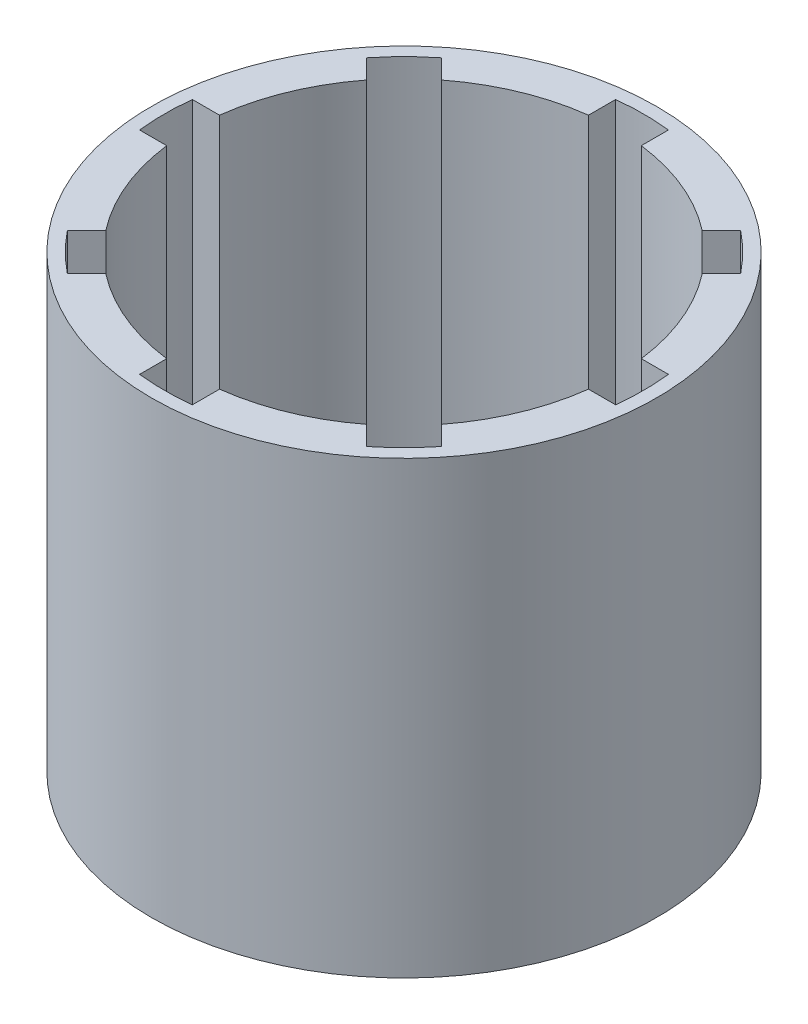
ISO-10303-21;
HEADER;
FILE_DESCRIPTION(('STEP AP214'),'2;1');
FILE_NAME('part.step','',(''),(''),'','','');
FILE_SCHEMA(('AUTOMOTIVE_DESIGN { 1 0 10303 214 1 1 1 1 }'));
ENDSEC;
DATA;
#1=APPLICATION_CONTEXT('core data for automotive mechanical design processes');
#2=APPLICATION_PROTOCOL_DEFINITION('international standard','automotive_design',2000,#1);
#3=PRODUCT_CONTEXT('',#1,'mechanical');
#4=PRODUCT('Part','Part','',(#3));
#5=PRODUCT_RELATED_PRODUCT_CATEGORY('part','',(#4));
#6=PRODUCT_DEFINITION_FORMATION('','',#4);
#7=PRODUCT_DEFINITION_CONTEXT('part definition',#1,'design');
#8=PRODUCT_DEFINITION('design','',#6,#7);
#9=PRODUCT_DEFINITION_SHAPE('','',#8);
#10=(LENGTH_UNIT() NAMED_UNIT(*) SI_UNIT(.MILLI.,.METRE.));
#11=(NAMED_UNIT(*) PLANE_ANGLE_UNIT() SI_UNIT($,.RADIAN.));
#12=(NAMED_UNIT(*) SI_UNIT($,.STERADIAN.) SOLID_ANGLE_UNIT());
#13=UNCERTAINTY_MEASURE_WITH_UNIT(LENGTH_MEASURE(1.E-05),#10,'distance_accuracy_value','');
#14=(GEOMETRIC_REPRESENTATION_CONTEXT(3) GLOBAL_UNCERTAINTY_ASSIGNED_CONTEXT((#13)) GLOBAL_UNIT_ASSIGNED_CONTEXT((#10,
#11,#12)) REPRESENTATION_CONTEXT('',''));
#15=CARTESIAN_POINT('',(0.,0.,0.));
#16=DIRECTION('',(0.,0.,1.));
#17=DIRECTION('',(1.,0.,0.));
#18=AXIS2_PLACEMENT_3D('',#15,#16,#17);
#19=CARTESIAN_POINT('',(0.,90.,0.));
#20=DIRECTION('',(0.,-1.,0.));
#21=DIRECTION('',(0.,0.,-1.));
#22=AXIS2_PLACEMENT_3D('',#19,#20,#21);
#23=CYLINDRICAL_SURFACE('',#22,42.5);
#24=DIRECTION('',(0.,-1.,0.));
#25=VECTOR('',#24,1.);
#26=CARTESIAN_POINT('',(-26.0858748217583,90.,-33.5526025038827));
#27=LINE('',#26,#25);
#28=CARTESIAN_POINT('',(-26.0858748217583,0.,-33.5526025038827));
#29=VERTEX_POINT('',#28);
#30=CARTESIAN_POINT('',(-26.0858748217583,90.,-33.5526025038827));
#31=VERTEX_POINT('',#30);
#32=EDGE_CURVE('E272',#29,#31,#27,.F.);
#33=ORIENTED_EDGE('',*,*,#32,.F.);
#34=CARTESIAN_POINT('',(0.,0.,0.));
#35=DIRECTION('',(0.,1.,0.));
#36=DIRECTION('',(0.,0.,1.));
#37=AXIS2_PLACEMENT_3D('',#34,#35,#36);
#38=CIRCLE('',#37,42.5);
#39=CARTESIAN_POINT('',(-5.27977377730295,0.,-42.170771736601));
#40=VERTEX_POINT('',#39);
#41=EDGE_CURVE('E436',#40,#29,#38,.T.);
#42=ORIENTED_EDGE('',*,*,#41,.F.);
#43=DIRECTION('',(0.,-1.,0.));
#44=VECTOR('',#43,1.);
#45=CARTESIAN_POINT('',(-5.27977377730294,90.,-42.170771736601));
#46=LINE('',#45,#44);
#47=CARTESIAN_POINT('',(-5.27977377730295,90.,-42.170771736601));
#48=VERTEX_POINT('',#47);
#49=EDGE_CURVE('E442',#48,#40,#46,.T.);
#50=ORIENTED_EDGE('',*,*,#49,.F.);
#51=CARTESIAN_POINT('',(0.,90.,0.));
#52=DIRECTION('',(0.,1.,0.));
#53=DIRECTION('',(0.,0.,1.));
#54=AXIS2_PLACEMENT_3D('',#51,#52,#53);
#55=CIRCLE('',#54,42.5);
#56=EDGE_CURVE('E430',#48,#31,#55,.T.);
#57=ORIENTED_EDGE('',*,*,#56,.T.);
#58=EDGE_LOOP('',(#33,#42,#50,#57));
#59=FACE_BOUND('',#58,.T.);
#60=ADVANCED_FACE('F35',(#59),#23,.F.);
#61=DIRECTION('',(0.,-1.,0.));
#62=VECTOR('',#61,1.);
#63=CARTESIAN_POINT('',(-33.5526025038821,90.,-26.0858748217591));
#64=LINE('',#63,#62);
#65=CARTESIAN_POINT('',(-33.5526025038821,90.,-26.0858748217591));
#66=VERTEX_POINT('',#65);
#67=CARTESIAN_POINT('',(-33.5526025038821,0.,-26.0858748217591));
#68=VERTEX_POINT('',#67);
#69=EDGE_CURVE('E50',#66,#68,#64,.T.);
#70=ORIENTED_EDGE('',*,*,#69,.F.);
#71=CARTESIAN_POINT('',(-42.1707717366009,90.,-5.27977377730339));
#72=VERTEX_POINT('',#71);
#73=EDGE_CURVE('E434',#66,#72,#55,.T.);
#74=ORIENTED_EDGE('',*,*,#73,.T.);
#75=DIRECTION('',(0.,-1.,0.));
#76=VECTOR('',#75,1.);
#77=CARTESIAN_POINT('',(-42.1707717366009,90.,-5.27977377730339));
#78=LINE('',#77,#76);
#79=CARTESIAN_POINT('',(-42.1707717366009,0.,-5.27977377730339));
#80=VERTEX_POINT('',#79);
#81=EDGE_CURVE('E292',#80,#72,#78,.F.);
#82=ORIENTED_EDGE('',*,*,#81,.F.);
#83=EDGE_CURVE('E438',#68,#80,#38,.T.);
#84=ORIENTED_EDGE('',*,*,#83,.F.);
#85=EDGE_LOOP('',(#70,#74,#82,#84));
#86=FACE_BOUND('',#85,.T.);
#87=ADVANCED_FACE('F473',(#86),#23,.F.);
#88=DIRECTION('',(0.,-1.,0.));
#89=VECTOR('',#88,1.);
#90=CARTESIAN_POINT('',(-42.170771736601,90.,5.2797737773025));
#91=LINE('',#90,#89);
#92=CARTESIAN_POINT('',(-42.170771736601,90.,5.2797737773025));
#93=VERTEX_POINT('',#92);
#94=CARTESIAN_POINT('',(-42.170771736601,0.,5.2797737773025));
#95=VERTEX_POINT('',#94);
#96=EDGE_CURVE('E58',#93,#95,#91,.T.);
#97=ORIENTED_EDGE('',*,*,#96,.F.);
#98=CARTESIAN_POINT('',(-33.5526025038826,90.,26.0858748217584));
#99=VERTEX_POINT('',#98);
#100=EDGE_CURVE('E476',#93,#99,#55,.T.);
#101=ORIENTED_EDGE('',*,*,#100,.T.);
#102=DIRECTION('',(0.,-1.,0.));
#103=VECTOR('',#102,1.);
#104=CARTESIAN_POINT('',(-33.5526025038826,90.,26.0858748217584));
#105=LINE('',#104,#103);
#106=CARTESIAN_POINT('',(-33.5526025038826,0.,26.0858748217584));
#107=VERTEX_POINT('',#106);
#108=EDGE_CURVE('E315',#107,#99,#105,.F.);
#109=ORIENTED_EDGE('',*,*,#108,.F.);
#110=EDGE_CURVE('E532',#95,#107,#38,.T.);
#111=ORIENTED_EDGE('',*,*,#110,.F.);
#112=EDGE_LOOP('',(#97,#101,#109,#111));
#113=FACE_BOUND('',#112,.T.);
#114=ADVANCED_FACE('F541',(#113),#23,.F.);
#115=DIRECTION('',(0.,-1.,0.));
#116=VECTOR('',#115,1.);
#117=CARTESIAN_POINT('',(-26.085874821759,90.,33.5526025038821));
#118=LINE('',#117,#116);
#119=CARTESIAN_POINT('',(-26.085874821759,90.,33.5526025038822));
#120=VERTEX_POINT('',#119);
#121=CARTESIAN_POINT('',(-26.085874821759,0.,33.5526025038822));
#122=VERTEX_POINT('',#121);
#123=EDGE_CURVE('E312',#120,#122,#118,.T.);
#124=ORIENTED_EDGE('',*,*,#123,.F.);
#125=CARTESIAN_POINT('',(-5.27977377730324,90.,42.170771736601));
#126=VERTEX_POINT('',#125);
#127=EDGE_CURVE('E477',#120,#126,#55,.T.);
#128=ORIENTED_EDGE('',*,*,#127,.T.);
#129=DIRECTION('',(0.,-1.,0.));
#130=VECTOR('',#129,1.);
#131=CARTESIAN_POINT('',(-5.27977377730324,90.,42.1707717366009));
#132=LINE('',#131,#130);
#133=CARTESIAN_POINT('',(-5.27977377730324,0.,42.170771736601));
#134=VERTEX_POINT('',#133);
#135=EDGE_CURVE('E338',#134,#126,#132,.F.);
#136=ORIENTED_EDGE('',*,*,#135,.F.);
#137=EDGE_CURVE('E529',#122,#134,#38,.T.);
#138=ORIENTED_EDGE('',*,*,#137,.F.);
#139=EDGE_LOOP('',(#124,#128,#136,#138));
#140=FACE_BOUND('',#139,.T.);
#141=ADVANCED_FACE('F543',(#140),#23,.F.);
#142=DIRECTION('',(0.,-1.,0.));
#143=VECTOR('',#142,1.);
#144=CARTESIAN_POINT('',(5.27977377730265,90.,42.170771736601));
#145=LINE('',#144,#143);
#146=CARTESIAN_POINT('',(5.27977377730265,90.,42.170771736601));
#147=VERTEX_POINT('',#146);
#148=CARTESIAN_POINT('',(5.27977377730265,0.,42.170771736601));
#149=VERTEX_POINT('',#148);
#150=EDGE_CURVE('E335',#147,#149,#145,.T.);
#151=ORIENTED_EDGE('',*,*,#150,.F.);
#152=CARTESIAN_POINT('',(26.0858748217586,90.,33.5526025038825));
#153=VERTEX_POINT('',#152);
#154=EDGE_CURVE('E481',#147,#153,#55,.T.);
#155=ORIENTED_EDGE('',*,*,#154,.T.);
#156=DIRECTION('',(0.,-1.,0.));
#157=VECTOR('',#156,1.);
#158=CARTESIAN_POINT('',(26.0858748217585,90.,33.5526025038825));
#159=LINE('',#158,#157);
#160=CARTESIAN_POINT('',(26.0858748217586,0.,33.5526025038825));
#161=VERTEX_POINT('',#160);
#162=EDGE_CURVE('E361',#161,#153,#159,.F.);
#163=ORIENTED_EDGE('',*,*,#162,.F.);
#164=EDGE_CURVE('E526',#149,#161,#38,.T.);
#165=ORIENTED_EDGE('',*,*,#164,.F.);
#166=EDGE_LOOP('',(#151,#155,#163,#165));
#167=FACE_BOUND('',#166,.T.);
#168=ADVANCED_FACE('F549',(#167),#23,.F.);
#169=DIRECTION('',(0.,-1.,0.));
#170=VECTOR('',#169,1.);
#171=CARTESIAN_POINT('',(33.5526025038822,90.,26.0858748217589));
#172=LINE('',#171,#170);
#173=CARTESIAN_POINT('',(33.5526025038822,90.,26.0858748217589));
#174=VERTEX_POINT('',#173);
#175=CARTESIAN_POINT('',(33.5526025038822,0.,26.0858748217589));
#176=VERTEX_POINT('',#175);
#177=EDGE_CURVE('E358',#174,#176,#172,.T.);
#178=ORIENTED_EDGE('',*,*,#177,.F.);
#179=CARTESIAN_POINT('',(42.170771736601,90.,5.27977377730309));
#180=VERTEX_POINT('',#179);
#181=EDGE_CURVE('E486',#174,#180,#55,.T.);
#182=ORIENTED_EDGE('',*,*,#181,.T.);
#183=DIRECTION('',(0.,-1.,0.));
#184=VECTOR('',#183,1.);
#185=CARTESIAN_POINT('',(42.170771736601,90.,5.27977377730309));
#186=LINE('',#185,#184);
#187=CARTESIAN_POINT('',(42.170771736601,0.,5.27977377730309));
#188=VERTEX_POINT('',#187);
#189=EDGE_CURVE('E384',#188,#180,#186,.F.);
#190=ORIENTED_EDGE('',*,*,#189,.F.);
#191=EDGE_CURVE('E523',#176,#188,#38,.T.);
#192=ORIENTED_EDGE('',*,*,#191,.F.);
#193=EDGE_LOOP('',(#178,#182,#190,#192));
#194=FACE_BOUND('',#193,.T.);
#195=ADVANCED_FACE('F565',(#194),#23,.F.);
#196=DIRECTION('',(0.,-1.,0.));
#197=VECTOR('',#196,1.);
#198=CARTESIAN_POINT('',(42.170771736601,90.,-5.2797737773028));
#199=LINE('',#198,#197);
#200=CARTESIAN_POINT('',(42.170771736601,90.,-5.2797737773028));
#201=VERTEX_POINT('',#200);
#202=CARTESIAN_POINT('',(42.170771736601,0.,-5.2797737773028));
#203=VERTEX_POINT('',#202);
#204=EDGE_CURVE('E381',#201,#203,#199,.T.);
#205=ORIENTED_EDGE('',*,*,#204,.F.);
#206=CARTESIAN_POINT('',(33.5526025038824,90.,-26.0858748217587));
#207=VERTEX_POINT('',#206);
#208=EDGE_CURVE('E491',#201,#207,#55,.T.);
#209=ORIENTED_EDGE('',*,*,#208,.T.);
#210=DIRECTION('',(0.,-1.,0.));
#211=VECTOR('',#210,1.);
#212=CARTESIAN_POINT('',(33.5526025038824,90.,-26.0858748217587));
#213=LINE('',#212,#211);
#214=CARTESIAN_POINT('',(33.5526025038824,0.,-26.0858748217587));
#215=VERTEX_POINT('',#214);
#216=EDGE_CURVE('E451',#215,#207,#213,.F.);
#217=ORIENTED_EDGE('',*,*,#216,.F.);
#218=EDGE_CURVE('E522',#203,#215,#38,.T.);
#219=ORIENTED_EDGE('',*,*,#218,.F.);
#220=EDGE_LOOP('',(#205,#209,#217,#219));
#221=FACE_BOUND('',#220,.T.);
#222=ADVANCED_FACE('F558',(#221),#23,.F.);
#223=CARTESIAN_POINT('',(0.,90.,0.));
#224=DIRECTION('',(0.,1.,0.));
#225=DIRECTION('',(0.,0.,1.));
#226=AXIS2_PLACEMENT_3D('',#223,#224,#225);
#227=PLANE('',#226);
#228=DIRECTION('',(-0.707106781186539,0.,-0.707106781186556));
#229=VECTOR('',#228,1.);
#230=CARTESIAN_POINT('',(-29.9281134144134,90.,-37.3948410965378));
#231=LINE('',#230,#229);
#232=CARTESIAN_POINT('',(-29.9281134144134,90.,-37.3948410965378));
#233=VERTEX_POINT('',#232);
#234=EDGE_CURVE('E263',#31,#233,#231,.T.);
#235=ORIENTED_EDGE('',*,*,#234,.F.);
#236=ORIENTED_EDGE('',*,*,#56,.F.);
#237=DIRECTION('',(0.,0.,1.));
#238=VECTOR('',#237,1.);
#239=CARTESIAN_POINT('',(-5.27977377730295,90.,-47.6045176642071));
#240=LINE('',#239,#238);
#241=CARTESIAN_POINT('',(-5.27977377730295,90.,-47.6045176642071));
#242=VERTEX_POINT('',#241);
#243=EDGE_CURVE('E422',#242,#48,#240,.T.);
#244=ORIENTED_EDGE('',*,*,#243,.F.);
#245=CARTESIAN_POINT('',(0.,90.,0.));
#246=DIRECTION('',(0.,1.,0.));
#247=DIRECTION('',(0.,0.,-1.));
#248=AXIS2_PLACEMENT_3D('',#245,#246,#247);
#249=CIRCLE('',#248,47.8964102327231);
#250=CARTESIAN_POINT('',(5.27977377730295,90.,-47.6045176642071));
#251=VERTEX_POINT('',#250);
#252=EDGE_CURVE('E407',#251,#242,#249,.T.);
#253=ORIENTED_EDGE('',*,*,#252,.F.);
#254=DIRECTION('',(0.,0.,-1.));
#255=VECTOR('',#254,1.);
#256=CARTESIAN_POINT('',(5.27977377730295,90.,-47.6045176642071));
#257=LINE('',#256,#255);
#258=CARTESIAN_POINT('',(5.27977377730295,90.,-42.170771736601));
#259=VERTEX_POINT('',#258);
#260=EDGE_CURVE('E413',#259,#251,#257,.T.);
#261=ORIENTED_EDGE('',*,*,#260,.F.);
#262=CARTESIAN_POINT('',(26.0858748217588,90.,-33.5526025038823));
#263=VERTEX_POINT('',#262);
#264=EDGE_CURVE('E435',#263,#259,#55,.T.);
#265=ORIENTED_EDGE('',*,*,#264,.F.);
#266=DIRECTION('',(-0.707106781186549,0.,0.707106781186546));
#267=VECTOR('',#266,1.);
#268=CARTESIAN_POINT('',(29.9281134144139,90.,-37.3948410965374));
#269=LINE('',#268,#267);
#270=CARTESIAN_POINT('',(29.9281134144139,90.,-37.3948410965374));
#271=VERTEX_POINT('',#270);
#272=EDGE_CURVE('E401',#271,#263,#269,.T.);
#273=ORIENTED_EDGE('',*,*,#272,.F.);
#274=CARTESIAN_POINT('',(0.,90.,0.));
#275=DIRECTION('',(0.,1.,0.));
#276=DIRECTION('',(0.,0.,-1.));
#277=AXIS2_PLACEMENT_3D('',#274,#275,#276);
#278=CIRCLE('',#277,47.8964102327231);
#279=CARTESIAN_POINT('',(37.3948410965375,90.,-29.9281134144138));
#280=VERTEX_POINT('',#279);
#281=EDGE_CURVE('E387',#280,#271,#278,.T.);
#282=ORIENTED_EDGE('',*,*,#281,.F.);
#283=DIRECTION('',(0.707106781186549,0.,-0.707106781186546));
#284=VECTOR('',#283,1.);
#285=CARTESIAN_POINT('',(37.3948410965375,90.,-29.9281134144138));
#286=LINE('',#285,#284);
#287=EDGE_CURVE('E392',#207,#280,#286,.T.);
#288=ORIENTED_EDGE('',*,*,#287,.F.);
#289=ORIENTED_EDGE('',*,*,#208,.F.);
#290=DIRECTION('',(-1.,0.,0.));
#291=VECTOR('',#290,1.);
#292=CARTESIAN_POINT('',(47.6045176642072,90.,-5.27977377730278));
#293=LINE('',#292,#291);
#294=CARTESIAN_POINT('',(47.6045176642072,90.,-5.27977377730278));
#295=VERTEX_POINT('',#294);
#296=EDGE_CURVE('E375',#295,#201,#293,.T.);
#297=ORIENTED_EDGE('',*,*,#296,.F.);
#298=CARTESIAN_POINT('',(0.,90.,0.));
#299=DIRECTION('',(0.,1.,0.));
#300=DIRECTION('',(0.,0.,-1.));
#301=AXIS2_PLACEMENT_3D('',#298,#299,#300);
#302=CIRCLE('',#301,47.8964102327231);
#303=CARTESIAN_POINT('',(47.6045176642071,90.,5.27977377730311));
#304=VERTEX_POINT('',#303);
#305=EDGE_CURVE('E364',#304,#295,#302,.T.);
#306=ORIENTED_EDGE('',*,*,#305,.F.);
#307=DIRECTION('',(1.,0.,0.));
#308=VECTOR('',#307,1.);
#309=CARTESIAN_POINT('',(47.6045176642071,90.,5.27977377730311));
#310=LINE('',#309,#308);
#311=EDGE_CURVE('E369',#180,#304,#310,.T.);
#312=ORIENTED_EDGE('',*,*,#311,.F.);
#313=ORIENTED_EDGE('',*,*,#181,.F.);
#314=DIRECTION('',(-0.707106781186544,0.,-0.707106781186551));
#315=VECTOR('',#314,1.);
#316=CARTESIAN_POINT('',(37.3948410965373,90.,29.928113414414));
#317=LINE('',#316,#315);
#318=CARTESIAN_POINT('',(37.3948410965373,90.,29.928113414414));
#319=VERTEX_POINT('',#318);
#320=EDGE_CURVE('E352',#319,#174,#317,.T.);
#321=ORIENTED_EDGE('',*,*,#320,.F.);
#322=CARTESIAN_POINT('',(0.,90.,0.));
#323=DIRECTION('',(0.,1.,0.));
#324=DIRECTION('',(0.,0.,-1.));
#325=AXIS2_PLACEMENT_3D('',#322,#323,#324);
#326=CIRCLE('',#325,47.8964102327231);
#327=CARTESIAN_POINT('',(29.9281134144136,90.,37.3948410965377));
#328=VERTEX_POINT('',#327);
#329=EDGE_CURVE('E341',#328,#319,#326,.T.);
#330=ORIENTED_EDGE('',*,*,#329,.F.);
#331=DIRECTION('',(0.707106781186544,0.,0.707106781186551));
#332=VECTOR('',#331,1.);
#333=CARTESIAN_POINT('',(29.9281134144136,90.,37.3948410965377));
#334=LINE('',#333,#332);
#335=EDGE_CURVE('E346',#153,#328,#334,.T.);
#336=ORIENTED_EDGE('',*,*,#335,.F.);
#337=ORIENTED_EDGE('',*,*,#154,.F.);
#338=DIRECTION('',(0.,0.,-1.));
#339=VECTOR('',#338,1.);
#340=CARTESIAN_POINT('',(5.27977377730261,90.,47.6045176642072));
#341=LINE('',#340,#339);
#342=CARTESIAN_POINT('',(5.27977377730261,90.,47.6045176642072));
#343=VERTEX_POINT('',#342);
#344=EDGE_CURVE('E329',#343,#147,#341,.T.);
#345=ORIENTED_EDGE('',*,*,#344,.F.);
#346=CARTESIAN_POINT('',(0.,90.,0.));
#347=DIRECTION('',(0.,1.,0.));
#348=DIRECTION('',(0.,0.,-1.));
#349=AXIS2_PLACEMENT_3D('',#346,#347,#348);
#350=CIRCLE('',#349,47.8964102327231);
#351=CARTESIAN_POINT('',(-5.27977377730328,90.,47.6045176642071));
#352=VERTEX_POINT('',#351);
#353=EDGE_CURVE('E318',#352,#343,#350,.T.);
#354=ORIENTED_EDGE('',*,*,#353,.F.);
#355=DIRECTION('',(0.,0.,1.));
#356=VECTOR('',#355,1.);
#357=CARTESIAN_POINT('',(-5.27977377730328,90.,47.6045176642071));
#358=LINE('',#357,#356);
#359=EDGE_CURVE('E323',#126,#352,#358,.T.);
#360=ORIENTED_EDGE('',*,*,#359,.F.);
#361=ORIENTED_EDGE('',*,*,#127,.F.);
#362=DIRECTION('',(0.707106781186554,0.,-0.707106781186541));
#363=VECTOR('',#362,1.);
#364=CARTESIAN_POINT('',(-29.9281134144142,90.,37.3948410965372));
#365=LINE('',#364,#363);
#366=CARTESIAN_POINT('',(-29.9281134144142,90.,37.3948410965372));
#367=VERTEX_POINT('',#366);
#368=EDGE_CURVE('E306',#367,#120,#365,.T.);
#369=ORIENTED_EDGE('',*,*,#368,.F.);
#370=CARTESIAN_POINT('',(0.,90.,0.));
#371=DIRECTION('',(0.,1.,0.));
#372=DIRECTION('',(0.,0.,-1.));
#373=AXIS2_PLACEMENT_3D('',#370,#371,#372);
#374=CIRCLE('',#373,47.8964102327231);
#375=CARTESIAN_POINT('',(-37.3948410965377,90.,29.9281134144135));
#376=VERTEX_POINT('',#375);
#377=EDGE_CURVE('E295',#376,#367,#374,.T.);
#378=ORIENTED_EDGE('',*,*,#377,.F.);
#379=DIRECTION('',(-0.707106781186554,0.,0.707106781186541));
#380=VECTOR('',#379,1.);
#381=CARTESIAN_POINT('',(-37.3948410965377,90.,29.9281134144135));
#382=LINE('',#381,#380);
#383=EDGE_CURVE('E300',#99,#376,#382,.T.);
#384=ORIENTED_EDGE('',*,*,#383,.F.);
#385=ORIENTED_EDGE('',*,*,#100,.F.);
#386=DIRECTION('',(1.,0.,0.));
#387=VECTOR('',#386,1.);
#388=CARTESIAN_POINT('',(-47.6045176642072,90.,5.27977377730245));
#389=LINE('',#388,#387);
#390=CARTESIAN_POINT('',(-47.6045176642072,90.,5.27977377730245));
#391=VERTEX_POINT('',#390);
#392=EDGE_CURVE('E284',#391,#93,#389,.T.);
#393=ORIENTED_EDGE('',*,*,#392,.F.);
#394=CARTESIAN_POINT('',(0.,90.,0.));
#395=DIRECTION('',(0.,1.,0.));
#396=DIRECTION('',(0.,0.,-1.));
#397=AXIS2_PLACEMENT_3D('',#394,#395,#396);
#398=CIRCLE('',#397,47.8964102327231);
#399=CARTESIAN_POINT('',(-47.6045176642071,90.,-5.27977377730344));
#400=VERTEX_POINT('',#399);
#401=EDGE_CURVE('E274',#400,#391,#398,.T.);
#402=ORIENTED_EDGE('',*,*,#401,.F.);
#403=DIRECTION('',(-1.,0.,0.));
#404=VECTOR('',#403,1.);
#405=CARTESIAN_POINT('',(-47.6045176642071,90.,-5.27977377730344));
#406=LINE('',#405,#404);
#407=EDGE_CURVE('E279',#72,#400,#406,.T.);
#408=ORIENTED_EDGE('',*,*,#407,.F.);
#409=ORIENTED_EDGE('',*,*,#73,.F.);
#410=DIRECTION('',(0.707106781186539,0.,0.707106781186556));
#411=VECTOR('',#410,1.);
#412=CARTESIAN_POINT('',(-37.3948410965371,90.,-29.9281134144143));
#413=LINE('',#412,#411);
#414=CARTESIAN_POINT('',(-37.3948410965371,90.,-29.9281134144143));
#415=VERTEX_POINT('',#414);
#416=EDGE_CURVE('E265',#415,#66,#413,.T.);
#417=ORIENTED_EDGE('',*,*,#416,.F.);
#418=CARTESIAN_POINT('',(0.,90.,0.));
#419=DIRECTION('',(0.,1.,0.));
#420=DIRECTION('',(0.,0.,-1.));
#421=AXIS2_PLACEMENT_3D('',#418,#419,#420);
#422=CIRCLE('',#421,47.8964102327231);
#423=EDGE_CURVE('E252',#233,#415,#422,.T.);
#424=ORIENTED_EDGE('',*,*,#423,.F.);
#425=EDGE_LOOP('',(#235,#236,#244,#253,#261,#265,#273,#282,#288,#289,#297,#306,#312,#313,#321,
#330,#336,#337,#345,#354,#360,#361,#369,#378,#384,#385,#393,#402,#408,#409,#417,#424));
#426=FACE_BOUND('',#425,.T.);
#427=CARTESIAN_POINT('',(0.,90.,0.));
#428=DIRECTION('',(0.,1.,0.));
#429=DIRECTION('',(0.,0.,1.));
#430=AXIS2_PLACEMENT_3D('',#427,#428,#429);
#431=CIRCLE('',#430,50.5);
#432=CARTESIAN_POINT('',(0.,90.,-50.5));
#433=VERTEX_POINT('',#432);
#434=EDGE_CURVE('E439',#433,#433,#431,.T.);
#435=ORIENTED_EDGE('',*,*,#434,.T.);
#436=EDGE_LOOP('',(#435));
#437=FACE_BOUND('',#436,.T.);
#438=ADVANCED_FACE('F513',(#426,#437),#227,.T.);
#439=CARTESIAN_POINT('',(0.,0.,0.));
#440=DIRECTION('',(0.,1.,0.));
#441=DIRECTION('',(0.,0.,1.));
#442=AXIS2_PLACEMENT_3D('',#439,#440,#441);
#443=PLANE('',#442);
#444=CARTESIAN_POINT('',(0.,0.,0.));
#445=DIRECTION('',(0.,1.,0.));
#446=DIRECTION('',(0.,0.,1.));
#447=AXIS2_PLACEMENT_3D('',#444,#445,#446);
#448=CIRCLE('',#447,50.5);
#449=CARTESIAN_POINT('',(0.,0.,-50.5));
#450=VERTEX_POINT('',#449);
#451=EDGE_CURVE('E433',#450,#450,#448,.T.);
#452=ORIENTED_EDGE('',*,*,#451,.F.);
#453=EDGE_LOOP('',(#452));
#454=FACE_BOUND('',#453,.T.);
#455=ORIENTED_EDGE('',*,*,#41,.T.);
#456=DIRECTION('',(-0.707106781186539,0.,-0.707106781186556));
#457=VECTOR('',#456,1.);
#458=CARTESIAN_POINT('',(3.73336384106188,0.,-3.73336384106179));
#459=LINE('',#458,#457);
#460=CARTESIAN_POINT('',(-29.9281134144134,0.,-37.3948410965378));
#461=VERTEX_POINT('',#460);
#462=EDGE_CURVE('E11',#29,#461,#459,.T.);
#463=ORIENTED_EDGE('',*,*,#462,.T.);
#464=CARTESIAN_POINT('',(0.,0.,0.));
#465=DIRECTION('',(0.,1.,0.));
#466=DIRECTION('',(0.,0.,-1.));
#467=AXIS2_PLACEMENT_3D('',#464,#465,#466);
#468=CIRCLE('',#467,47.8964102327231);
#469=CARTESIAN_POINT('',(-37.3948410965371,0.,-29.9281134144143));
#470=VERTEX_POINT('',#469);
#471=EDGE_CURVE('E250',#461,#470,#468,.T.);
#472=ORIENTED_EDGE('',*,*,#471,.T.);
#473=DIRECTION('',(0.707106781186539,0.,0.707106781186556));
#474=VECTOR('',#473,1.);
#475=CARTESIAN_POINT('',(-37.3948410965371,0.,-29.9281134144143));
#476=LINE('',#475,#474);
#477=EDGE_CURVE('E255',#470,#68,#476,.T.);
#478=ORIENTED_EDGE('',*,*,#477,.T.);
#479=ORIENTED_EDGE('',*,*,#83,.T.);
#480=DIRECTION('',(-1.,0.,0.));
#481=VECTOR('',#480,1.);
#482=CARTESIAN_POINT('',(0.,0.,-5.27977377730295));
#483=LINE('',#482,#481);
#484=CARTESIAN_POINT('',(-47.6045176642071,0.,-5.27977377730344));
#485=VERTEX_POINT('',#484);
#486=EDGE_CURVE('E43',#80,#485,#483,.T.);
#487=ORIENTED_EDGE('',*,*,#486,.T.);
#488=CARTESIAN_POINT('',(0.,0.,0.));
#489=DIRECTION('',(0.,1.,0.));
#490=DIRECTION('',(0.,0.,-1.));
#491=AXIS2_PLACEMENT_3D('',#488,#489,#490);
#492=CIRCLE('',#491,47.8964102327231);
#493=CARTESIAN_POINT('',(-47.6045176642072,0.,5.27977377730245));
#494=VERTEX_POINT('',#493);
#495=EDGE_CURVE('E275',#485,#494,#492,.T.);
#496=ORIENTED_EDGE('',*,*,#495,.T.);
#497=DIRECTION('',(1.,0.,0.));
#498=VECTOR('',#497,1.);
#499=CARTESIAN_POINT('',(-47.6045176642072,0.,5.27977377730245));
#500=LINE('',#499,#498);
#501=EDGE_CURVE('E278',#494,#95,#500,.T.);
#502=ORIENTED_EDGE('',*,*,#501,.T.);
#503=ORIENTED_EDGE('',*,*,#110,.T.);
#504=DIRECTION('',(-0.707106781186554,0.,0.707106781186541));
#505=VECTOR('',#504,1.);
#506=CARTESIAN_POINT('',(-3.73336384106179,0.,-3.73336384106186));
#507=LINE('',#506,#505);
#508=CARTESIAN_POINT('',(-37.3948410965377,0.,29.9281134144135));
#509=VERTEX_POINT('',#508);
#510=EDGE_CURVE('E463',#107,#509,#507,.T.);
#511=ORIENTED_EDGE('',*,*,#510,.T.);
#512=CARTESIAN_POINT('',(0.,0.,0.));
#513=DIRECTION('',(0.,1.,0.));
#514=DIRECTION('',(0.,0.,-1.));
#515=AXIS2_PLACEMENT_3D('',#512,#513,#514);
#516=CIRCLE('',#515,47.8964102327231);
#517=CARTESIAN_POINT('',(-29.9281134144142,0.,37.3948410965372));
#518=VERTEX_POINT('',#517);
#519=EDGE_CURVE('E296',#509,#518,#516,.T.);
#520=ORIENTED_EDGE('',*,*,#519,.T.);
#521=DIRECTION('',(0.707106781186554,0.,-0.707106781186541));
#522=VECTOR('',#521,1.);
#523=CARTESIAN_POINT('',(-29.9281134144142,0.,37.3948410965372));
#524=LINE('',#523,#522);
#525=EDGE_CURVE('E299',#518,#122,#524,.T.);
#526=ORIENTED_EDGE('',*,*,#525,.T.);
#527=ORIENTED_EDGE('',*,*,#137,.T.);
#528=DIRECTION('',(0.,0.,1.));
#529=VECTOR('',#528,1.);
#530=CARTESIAN_POINT('',(-5.27977377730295,0.,0.));
#531=LINE('',#530,#529);
#532=CARTESIAN_POINT('',(-5.27977377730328,0.,47.6045176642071));
#533=VERTEX_POINT('',#532);
#534=EDGE_CURVE('E460',#134,#533,#531,.T.);
#535=ORIENTED_EDGE('',*,*,#534,.T.);
#536=CARTESIAN_POINT('',(0.,0.,0.));
#537=DIRECTION('',(0.,1.,0.));
#538=DIRECTION('',(0.,0.,-1.));
#539=AXIS2_PLACEMENT_3D('',#536,#537,#538);
#540=CIRCLE('',#539,47.8964102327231);
#541=CARTESIAN_POINT('',(5.27977377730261,0.,47.6045176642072));
#542=VERTEX_POINT('',#541);
#543=EDGE_CURVE('E319',#533,#542,#540,.T.);
#544=ORIENTED_EDGE('',*,*,#543,.T.);
#545=DIRECTION('',(0.,0.,-1.));
#546=VECTOR('',#545,1.);
#547=CARTESIAN_POINT('',(5.27977377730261,0.,47.6045176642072));
#548=LINE('',#547,#546);
#549=EDGE_CURVE('E322',#542,#149,#548,.T.);
#550=ORIENTED_EDGE('',*,*,#549,.T.);
#551=ORIENTED_EDGE('',*,*,#164,.T.);
#552=DIRECTION('',(0.707106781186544,0.,0.707106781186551));
#553=VECTOR('',#552,1.);
#554=CARTESIAN_POINT('',(-3.73336384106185,0.,3.73336384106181));
#555=LINE('',#554,#553);
#556=CARTESIAN_POINT('',(29.9281134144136,0.,37.3948410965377));
#557=VERTEX_POINT('',#556);
#558=EDGE_CURVE('E457',#161,#557,#555,.T.);
#559=ORIENTED_EDGE('',*,*,#558,.T.);
#560=CARTESIAN_POINT('',(0.,0.,0.));
#561=DIRECTION('',(0.,1.,0.));
#562=DIRECTION('',(0.,0.,-1.));
#563=AXIS2_PLACEMENT_3D('',#560,#561,#562);
#564=CIRCLE('',#563,47.8964102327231);
#565=CARTESIAN_POINT('',(37.3948410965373,0.,29.928113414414));
#566=VERTEX_POINT('',#565);
#567=EDGE_CURVE('E342',#557,#566,#564,.T.);
#568=ORIENTED_EDGE('',*,*,#567,.T.);
#569=DIRECTION('',(-0.707106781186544,0.,-0.707106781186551));
#570=VECTOR('',#569,1.);
#571=CARTESIAN_POINT('',(37.3948410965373,0.,29.928113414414));
#572=LINE('',#571,#570);
#573=EDGE_CURVE('E345',#566,#176,#572,.T.);
#574=ORIENTED_EDGE('',*,*,#573,.T.);
#575=ORIENTED_EDGE('',*,*,#191,.T.);
#576=DIRECTION('',(1.,0.,0.));
#577=VECTOR('',#576,1.);
#578=CARTESIAN_POINT('',(0.,0.,5.27977377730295));
#579=LINE('',#578,#577);
#580=CARTESIAN_POINT('',(47.6045176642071,0.,5.27977377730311));
#581=VERTEX_POINT('',#580);
#582=EDGE_CURVE('E454',#188,#581,#579,.T.);
#583=ORIENTED_EDGE('',*,*,#582,.T.);
#584=CARTESIAN_POINT('',(0.,0.,0.));
#585=DIRECTION('',(0.,1.,0.));
#586=DIRECTION('',(0.,0.,-1.));
#587=AXIS2_PLACEMENT_3D('',#584,#585,#586);
#588=CIRCLE('',#587,47.8964102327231);
#589=CARTESIAN_POINT('',(47.6045176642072,0.,-5.27977377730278));
#590=VERTEX_POINT('',#589);
#591=EDGE_CURVE('E365',#581,#590,#588,.T.);
#592=ORIENTED_EDGE('',*,*,#591,.T.);
#593=DIRECTION('',(-1.,0.,0.));
#594=VECTOR('',#593,1.);
#595=CARTESIAN_POINT('',(47.6045176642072,0.,-5.27977377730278));
#596=LINE('',#595,#594);
#597=EDGE_CURVE('E368',#590,#203,#596,.T.);
#598=ORIENTED_EDGE('',*,*,#597,.T.);
#599=ORIENTED_EDGE('',*,*,#218,.T.);
#600=DIRECTION('',(0.707106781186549,0.,-0.707106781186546));
#601=VECTOR('',#600,1.);
#602=CARTESIAN_POINT('',(37.3948410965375,0.,-29.9281134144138));
#603=LINE('',#602,#601);
#604=CARTESIAN_POINT('',(37.3948410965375,0.,-29.9281134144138));
#605=VERTEX_POINT('',#604);
#606=EDGE_CURVE('E395',#215,#605,#603,.T.);
#607=ORIENTED_EDGE('',*,*,#606,.T.);
#608=CARTESIAN_POINT('',(0.,0.,0.));
#609=DIRECTION('',(0.,1.,0.));
#610=DIRECTION('',(0.,0.,-1.));
#611=AXIS2_PLACEMENT_3D('',#608,#609,#610);
#612=CIRCLE('',#611,47.8964102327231);
#613=CARTESIAN_POINT('',(29.9281134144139,0.,-37.3948410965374));
#614=VERTEX_POINT('',#613);
#615=EDGE_CURVE('E388',#605,#614,#612,.T.);
#616=ORIENTED_EDGE('',*,*,#615,.T.);
#617=DIRECTION('',(-0.707106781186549,0.,0.707106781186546));
#618=VECTOR('',#617,1.);
#619=CARTESIAN_POINT('',(29.9281134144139,0.,-37.3948410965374));
#620=LINE('',#619,#618);
#621=CARTESIAN_POINT('',(26.0858748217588,0.,-33.5526025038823));
#622=VERTEX_POINT('',#621);
#623=EDGE_CURVE('E391',#614,#622,#620,.T.);
#624=ORIENTED_EDGE('',*,*,#623,.T.);
#625=CARTESIAN_POINT('',(5.27977377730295,0.,-42.170771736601));
#626=VERTEX_POINT('',#625);
#627=EDGE_CURVE('E428',#622,#626,#38,.T.);
#628=ORIENTED_EDGE('',*,*,#627,.T.);
#629=DIRECTION('',(0.,0.,-1.));
#630=VECTOR('',#629,1.);
#631=CARTESIAN_POINT('',(5.27977377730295,0.,-47.6045176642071));
#632=LINE('',#631,#630);
#633=CARTESIAN_POINT('',(5.27977377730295,0.,-47.6045176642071));
#634=VERTEX_POINT('',#633);
#635=EDGE_CURVE('E416',#626,#634,#632,.T.);
#636=ORIENTED_EDGE('',*,*,#635,.T.);
#637=CARTESIAN_POINT('',(0.,0.,0.));
#638=DIRECTION('',(0.,1.,0.));
#639=DIRECTION('',(0.,0.,-1.));
#640=AXIS2_PLACEMENT_3D('',#637,#638,#639);
#641=CIRCLE('',#640,47.8964102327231);
#642=CARTESIAN_POINT('',(-5.27977377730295,0.,-47.6045176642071));
#643=VERTEX_POINT('',#642);
#644=EDGE_CURVE('E409',#634,#643,#641,.T.);
#645=ORIENTED_EDGE('',*,*,#644,.T.);
#646=DIRECTION('',(0.,0.,1.));
#647=VECTOR('',#646,1.);
#648=CARTESIAN_POINT('',(-5.27977377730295,0.,-47.6045176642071));
#649=LINE('',#648,#647);
#650=EDGE_CURVE('E412',#643,#40,#649,.T.);
#651=ORIENTED_EDGE('',*,*,#650,.T.);
#652=EDGE_LOOP('',(#455,#463,#472,#478,#479,#487,#496,#502,#503,#511,#520,#526,#527,#535,#544,
#550,#551,#559,#568,#574,#575,#583,#592,#598,#599,#607,#616,#624,#628,#636,#645,#651));
#653=FACE_BOUND('',#652,.T.);
#654=ADVANCED_FACE('F262',(#454,#653),#443,.F.);
#655=CARTESIAN_POINT('',(0.,90.,0.));
#656=DIRECTION('',(0.,-1.,0.));
#657=DIRECTION('',(0.,0.,-1.));
#658=AXIS2_PLACEMENT_3D('',#655,#656,#657);
#659=CYLINDRICAL_SURFACE('',#658,50.5);
#660=CARTESIAN_POINT('',(0.,90.,-50.5));
#661=CARTESIAN_POINT('',(0.,89.0625,-50.5));
#662=CARTESIAN_POINT('',(0.,88.125,-50.5));
#663=CARTESIAN_POINT('',(0.,86.25,-50.5));
#664=CARTESIAN_POINT('',(0.,85.3125,-50.5));
#665=CARTESIAN_POINT('',(0.,83.4375,-50.5));
#666=CARTESIAN_POINT('',(0.,82.5,-50.5));
#667=CARTESIAN_POINT('',(0.,80.625,-50.5));
#668=CARTESIAN_POINT('',(0.,79.6875,-50.5));
#669=CARTESIAN_POINT('',(0.,77.8125,-50.5));
#670=CARTESIAN_POINT('',(0.,76.875,-50.5));
#671=CARTESIAN_POINT('',(0.,75.,-50.5));
#672=CARTESIAN_POINT('',(0.,74.0625,-50.5));
#673=CARTESIAN_POINT('',(0.,72.1875,-50.5));
#674=CARTESIAN_POINT('',(0.,71.25,-50.5));
#675=CARTESIAN_POINT('',(0.,69.375,-50.5));
#676=CARTESIAN_POINT('',(0.,68.4375,-50.5));
#677=CARTESIAN_POINT('',(0.,66.5625,-50.5));
#678=CARTESIAN_POINT('',(0.,65.625,-50.5));
#679=CARTESIAN_POINT('',(0.,63.75,-50.5));
#680=CARTESIAN_POINT('',(0.,62.8125,-50.5));
#681=CARTESIAN_POINT('',(0.,60.9375,-50.5));
#682=CARTESIAN_POINT('',(0.,60.,-50.5));
#683=CARTESIAN_POINT('',(0.,58.125,-50.5));
#684=CARTESIAN_POINT('',(0.,57.1875,-50.5));
#685=CARTESIAN_POINT('',(0.,55.3125,-50.5));
#686=CARTESIAN_POINT('',(0.,54.375,-50.5));
#687=CARTESIAN_POINT('',(0.,52.5,-50.5));
#688=CARTESIAN_POINT('',(0.,51.5625,-50.5));
#689=CARTESIAN_POINT('',(0.,49.6875,-50.5));
#690=CARTESIAN_POINT('',(0.,48.75,-50.5));
#691=CARTESIAN_POINT('',(0.,46.875,-50.5));
#692=CARTESIAN_POINT('',(0.,45.9375,-50.5));
#693=CARTESIAN_POINT('',(0.,44.0625,-50.5));
#694=CARTESIAN_POINT('',(0.,43.125,-50.5));
#695=CARTESIAN_POINT('',(0.,41.25,-50.5));
#696=CARTESIAN_POINT('',(0.,40.3125,-50.5));
#697=CARTESIAN_POINT('',(0.,38.4375,-50.5));
#698=CARTESIAN_POINT('',(0.,37.5,-50.5));
#699=CARTESIAN_POINT('',(0.,35.625,-50.5));
#700=CARTESIAN_POINT('',(0.,34.6875,-50.5));
#701=CARTESIAN_POINT('',(0.,32.8125,-50.5));
#702=CARTESIAN_POINT('',(0.,31.875,-50.5));
#703=CARTESIAN_POINT('',(0.,30.,-50.5));
#704=CARTESIAN_POINT('',(0.,29.0625,-50.5));
#705=CARTESIAN_POINT('',(0.,27.1875,-50.5));
#706=CARTESIAN_POINT('',(0.,26.25,-50.5));
#707=CARTESIAN_POINT('',(0.,24.375,-50.5));
#708=CARTESIAN_POINT('',(0.,23.4375,-50.5));
#709=CARTESIAN_POINT('',(0.,21.5625,-50.5));
#710=CARTESIAN_POINT('',(0.,20.625,-50.5));
#711=CARTESIAN_POINT('',(0.,18.75,-50.5));
#712=CARTESIAN_POINT('',(0.,17.8125,-50.5));
#713=CARTESIAN_POINT('',(0.,15.9375,-50.5));
#714=CARTESIAN_POINT('',(0.,15.,-50.5));
#715=CARTESIAN_POINT('',(0.,13.125,-50.5));
#716=CARTESIAN_POINT('',(0.,12.1875,-50.5));
#717=CARTESIAN_POINT('',(0.,10.3125,-50.5));
#718=CARTESIAN_POINT('',(0.,9.37499999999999,-50.5));
#719=CARTESIAN_POINT('',(0.,7.49999999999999,-50.5));
#720=CARTESIAN_POINT('',(0.,6.56249999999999,-50.5));
#721=CARTESIAN_POINT('',(0.,4.68749999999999,-50.5));
#722=CARTESIAN_POINT('',(0.,3.74999999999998,-50.5));
#723=CARTESIAN_POINT('',(0.,1.87499999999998,-50.5));
#724=CARTESIAN_POINT('',(0.,0.937499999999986,-50.5));
#725=CARTESIAN_POINT('',(0.,0.,-50.5));
#726=B_SPLINE_CURVE_WITH_KNOTS('',3,(#660,#661,#662,#663,#664,#665,#666,#667,#668,#669,#670,
#671,#672,#673,#674,#675,#676,#677,#678,#679,#680,#681,#682,#683,#684,#685,#686,#687,#688,#689,
#690,#691,#692,#693,#694,#695,#696,#697,#698,#699,#700,#701,#702,#703,#704,#705,#706,#707,#708,
#709,#710,#711,#712,#713,#714,#715,#716,#717,#718,#719,#720,#721,#722,#723,#724,#725),
.UNSPECIFIED.,.F.,.F.,(4,2,2,2,2,2,2,2,2,2,2,2,2,2,2,2,2,2,2,2,2,2,2,2,2,2,2,2,2,2,2,2,4),(0.,
2.81250000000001,5.62500000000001,8.43750000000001,11.25,14.0625,16.875,19.6875,22.5,25.3125,
28.125,30.9375,33.75,36.5625,39.375,42.1875,45.,47.8125,50.625,53.4375,56.25,59.0625,61.875,
64.6875,67.5,70.3125,73.125,75.9375,78.75,81.5625,84.375,87.1875,90.),.UNSPECIFIED.);
#727=EDGE_CURVE('BSEAM37',#433,#450,#726,.T.);
#728=ORIENTED_EDGE('',*,*,#434,.F.);
#729=ORIENTED_EDGE('',*,*,#451,.T.);
#730=ORIENTED_EDGE('',*,*,#727,.T.);
#731=ORIENTED_EDGE('',*,*,#727,.F.);
#732=EDGE_LOOP('',(#728,#730,#729,#731));
#733=FACE_BOUND('',#732,.T.);
#734=ADVANCED_FACE('F37',(#733),#659,.T.);
#735=DIRECTION('',(0.,-1.,0.));
#736=VECTOR('',#735,1.);
#737=CARTESIAN_POINT('',(26.0858748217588,90.,-33.5526025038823));
#738=LINE('',#737,#736);
#739=EDGE_CURVE('E449',#263,#622,#738,.T.);
#740=ORIENTED_EDGE('',*,*,#739,.F.);
#741=ORIENTED_EDGE('',*,*,#264,.T.);
#742=DIRECTION('',(0.,-1.,0.));
#743=VECTOR('',#742,1.);
#744=CARTESIAN_POINT('',(5.27977377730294,90.,-42.170771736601));
#745=LINE('',#744,#743);
#746=EDGE_CURVE('E446',#626,#259,#745,.F.);
#747=ORIENTED_EDGE('',*,*,#746,.F.);
#748=ORIENTED_EDGE('',*,*,#627,.F.);
#749=EDGE_LOOP('',(#740,#741,#747,#748));
#750=FACE_BOUND('',#749,.T.);
#751=ADVANCED_FACE('F504',(#750),#23,.F.);
#752=CARTESIAN_POINT('',(0.,0.,0.));
#753=DIRECTION('',(0.,1.,0.));
#754=DIRECTION('',(0.,0.,1.));
#755=AXIS2_PLACEMENT_3D('',#752,#753,#754);
#756=CYLINDRICAL_SURFACE('',#755,47.8964102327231);
#757=ORIENTED_EDGE('',*,*,#252,.T.);
#758=DIRECTION('',(0.,1.,0.));
#759=VECTOR('',#758,1.);
#760=CARTESIAN_POINT('',(-5.27977377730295,0.,-47.6045176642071));
#761=LINE('',#760,#759);
#762=EDGE_CURVE('E419',#643,#242,#761,.T.);
#763=ORIENTED_EDGE('',*,*,#762,.F.);
#764=ORIENTED_EDGE('',*,*,#644,.F.);
#765=DIRECTION('',(0.,1.,0.));
#766=VECTOR('',#765,1.);
#767=CARTESIAN_POINT('',(5.27977377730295,0.,-47.6045176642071));
#768=LINE('',#767,#766);
#769=EDGE_CURVE('E425',#634,#251,#768,.T.);
#770=ORIENTED_EDGE('',*,*,#769,.T.);
#771=EDGE_LOOP('',(#757,#763,#764,#770));
#772=FACE_BOUND('',#771,.T.);
#773=ADVANCED_FACE('F518',(#772),#756,.F.);
#774=CARTESIAN_POINT('',(5.27977377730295,0.,-47.6045176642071));
#775=DIRECTION('',(1.,0.,0.));
#776=DIRECTION('',(0.,0.,-1.));
#777=AXIS2_PLACEMENT_3D('',#774,#775,#776);
#778=PLANE('',#777);
#779=ORIENTED_EDGE('',*,*,#746,.T.);
#780=ORIENTED_EDGE('',*,*,#260,.T.);
#781=ORIENTED_EDGE('',*,*,#769,.F.);
#782=ORIENTED_EDGE('',*,*,#635,.F.);
#783=EDGE_LOOP('',(#779,#780,#781,#782));
#784=FACE_BOUND('',#783,.T.);
#785=ADVANCED_FACE('F510',(#784),#778,.F.);
#786=CARTESIAN_POINT('',(-5.27977377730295,0.,-47.6045176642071));
#787=DIRECTION('',(-1.,0.,0.));
#788=DIRECTION('',(0.,0.,1.));
#789=AXIS2_PLACEMENT_3D('',#786,#787,#788);
#790=PLANE('',#789);
#791=ORIENTED_EDGE('',*,*,#49,.T.);
#792=ORIENTED_EDGE('',*,*,#650,.F.);
#793=ORIENTED_EDGE('',*,*,#762,.T.);
#794=ORIENTED_EDGE('',*,*,#243,.T.);
#795=EDGE_LOOP('',(#791,#792,#793,#794));
#796=FACE_BOUND('',#795,.T.);
#797=ADVANCED_FACE('F597',(#796),#790,.F.);
#798=CARTESIAN_POINT('',(0.,0.,0.));
#799=DIRECTION('',(0.,1.,0.));
#800=DIRECTION('',(0.,0.,1.));
#801=AXIS2_PLACEMENT_3D('',#798,#799,#800);
#802=CYLINDRICAL_SURFACE('',#801,47.8964102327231);
#803=ORIENTED_EDGE('',*,*,#281,.T.);
#804=DIRECTION('',(0.,1.,0.));
#805=VECTOR('',#804,1.);
#806=CARTESIAN_POINT('',(29.9281134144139,0.,-37.3948410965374));
#807=LINE('',#806,#805);
#808=EDGE_CURVE('E398',#614,#271,#807,.T.);
#809=ORIENTED_EDGE('',*,*,#808,.F.);
#810=ORIENTED_EDGE('',*,*,#615,.F.);
#811=DIRECTION('',(0.,1.,0.));
#812=VECTOR('',#811,1.);
#813=CARTESIAN_POINT('',(37.3948410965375,0.,-29.9281134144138));
#814=LINE('',#813,#812);
#815=EDGE_CURVE('E404',#605,#280,#814,.T.);
#816=ORIENTED_EDGE('',*,*,#815,.T.);
#817=EDGE_LOOP('',(#803,#809,#810,#816));
#818=FACE_BOUND('',#817,.T.);
#819=ADVANCED_FACE('F580',(#818),#802,.F.);
#820=CARTESIAN_POINT('',(37.3948410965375,0.,-29.9281134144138));
#821=DIRECTION('',(0.707106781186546,0.,0.707106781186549));
#822=DIRECTION('',(0.707106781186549,0.,-0.707106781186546));
#823=AXIS2_PLACEMENT_3D('',#820,#821,#822);
#824=PLANE('',#823);
#825=ORIENTED_EDGE('',*,*,#216,.T.);
#826=ORIENTED_EDGE('',*,*,#287,.T.);
#827=ORIENTED_EDGE('',*,*,#815,.F.);
#828=ORIENTED_EDGE('',*,*,#606,.F.);
#829=EDGE_LOOP('',(#825,#826,#827,#828));
#830=FACE_BOUND('',#829,.T.);
#831=ADVANCED_FACE('F577',(#830),#824,.F.);
#832=CARTESIAN_POINT('',(29.9281134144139,0.,-37.3948410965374));
#833=DIRECTION('',(-0.707106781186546,0.,-0.707106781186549));
#834=DIRECTION('',(-0.707106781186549,0.,0.707106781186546));
#835=AXIS2_PLACEMENT_3D('',#832,#833,#834);
#836=PLANE('',#835);
#837=ORIENTED_EDGE('',*,*,#739,.T.);
#838=ORIENTED_EDGE('',*,*,#623,.F.);
#839=ORIENTED_EDGE('',*,*,#808,.T.);
#840=ORIENTED_EDGE('',*,*,#272,.T.);
#841=EDGE_LOOP('',(#837,#838,#839,#840));
#842=FACE_BOUND('',#841,.T.);
#843=ADVANCED_FACE('F582',(#842),#836,.F.);
#844=CARTESIAN_POINT('',(0.,0.,0.));
#845=DIRECTION('',(0.,1.,0.));
#846=DIRECTION('',(0.,0.,1.));
#847=AXIS2_PLACEMENT_3D('',#844,#845,#846);
#848=CYLINDRICAL_SURFACE('',#847,47.8964102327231);
#849=ORIENTED_EDGE('',*,*,#305,.T.);
#850=DIRECTION('',(0.,1.,0.));
#851=VECTOR('',#850,1.);
#852=CARTESIAN_POINT('',(47.6045176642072,0.,-5.27977377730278));
#853=LINE('',#852,#851);
#854=EDGE_CURVE('E372',#590,#295,#853,.T.);
#855=ORIENTED_EDGE('',*,*,#854,.F.);
#856=ORIENTED_EDGE('',*,*,#591,.F.);
#857=DIRECTION('',(0.,1.,0.));
#858=VECTOR('',#857,1.);
#859=CARTESIAN_POINT('',(47.6045176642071,0.,5.27977377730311));
#860=LINE('',#859,#858);
#861=EDGE_CURVE('E378',#581,#304,#860,.T.);
#862=ORIENTED_EDGE('',*,*,#861,.T.);
#863=EDGE_LOOP('',(#849,#855,#856,#862));
#864=FACE_BOUND('',#863,.T.);
#865=ADVANCED_FACE('F584',(#864),#848,.F.);
#866=CARTESIAN_POINT('',(47.6045176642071,0.,5.27977377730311));
#867=DIRECTION('',(0.,0.,1.));
#868=DIRECTION('',(1.,0.,0.));
#869=AXIS2_PLACEMENT_3D('',#866,#867,#868);
#870=PLANE('',#869);
#871=ORIENTED_EDGE('',*,*,#189,.T.);
#872=ORIENTED_EDGE('',*,*,#311,.T.);
#873=ORIENTED_EDGE('',*,*,#861,.F.);
#874=ORIENTED_EDGE('',*,*,#582,.F.);
#875=EDGE_LOOP('',(#871,#872,#873,#874));
#876=FACE_BOUND('',#875,.T.);
#877=ADVANCED_FACE('F590',(#876),#870,.F.);
#878=CARTESIAN_POINT('',(47.6045176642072,0.,-5.27977377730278));
#879=DIRECTION('',(0.,0.,-1.));
#880=DIRECTION('',(-1.,0.,0.));
#881=AXIS2_PLACEMENT_3D('',#878,#879,#880);
#882=PLANE('',#881);
#883=ORIENTED_EDGE('',*,*,#204,.T.);
#884=ORIENTED_EDGE('',*,*,#597,.F.);
#885=ORIENTED_EDGE('',*,*,#854,.T.);
#886=ORIENTED_EDGE('',*,*,#296,.T.);
#887=EDGE_LOOP('',(#883,#884,#885,#886));
#888=FACE_BOUND('',#887,.T.);
#889=ADVANCED_FACE('F659',(#888),#882,.F.);
#890=CARTESIAN_POINT('',(0.,0.,0.));
#891=DIRECTION('',(0.,1.,0.));
#892=DIRECTION('',(0.,0.,1.));
#893=AXIS2_PLACEMENT_3D('',#890,#891,#892);
#894=CYLINDRICAL_SURFACE('',#893,47.8964102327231);
#895=ORIENTED_EDGE('',*,*,#329,.T.);
#896=DIRECTION('',(0.,1.,0.));
#897=VECTOR('',#896,1.);
#898=CARTESIAN_POINT('',(37.3948410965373,0.,29.928113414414));
#899=LINE('',#898,#897);
#900=EDGE_CURVE('E349',#566,#319,#899,.T.);
#901=ORIENTED_EDGE('',*,*,#900,.F.);
#902=ORIENTED_EDGE('',*,*,#567,.F.);
#903=DIRECTION('',(0.,1.,0.));
#904=VECTOR('',#903,1.);
#905=CARTESIAN_POINT('',(29.9281134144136,0.,37.3948410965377));
#906=LINE('',#905,#904);
#907=EDGE_CURVE('E355',#557,#328,#906,.T.);
#908=ORIENTED_EDGE('',*,*,#907,.T.);
#909=EDGE_LOOP('',(#895,#901,#902,#908));
#910=FACE_BOUND('',#909,.T.);
#911=ADVANCED_FACE('F652',(#910),#894,.F.);
#912=CARTESIAN_POINT('',(29.9281134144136,0.,37.3948410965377));
#913=DIRECTION('',(-0.707106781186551,0.,0.707106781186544));
#914=DIRECTION('',(0.707106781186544,0.,0.707106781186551));
#915=AXIS2_PLACEMENT_3D('',#912,#913,#914);
#916=PLANE('',#915);
#917=ORIENTED_EDGE('',*,*,#162,.T.);
#918=ORIENTED_EDGE('',*,*,#335,.T.);
#919=ORIENTED_EDGE('',*,*,#907,.F.);
#920=ORIENTED_EDGE('',*,*,#558,.F.);
#921=EDGE_LOOP('',(#917,#918,#919,#920));
#922=FACE_BOUND('',#921,.T.);
#923=ADVANCED_FACE('F649',(#922),#916,.F.);
#924=CARTESIAN_POINT('',(37.3948410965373,0.,29.928113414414));
#925=DIRECTION('',(0.707106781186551,0.,-0.707106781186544));
#926=DIRECTION('',(-0.707106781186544,0.,-0.707106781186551));
#927=AXIS2_PLACEMENT_3D('',#924,#925,#926);
#928=PLANE('',#927);
#929=ORIENTED_EDGE('',*,*,#177,.T.);
#930=ORIENTED_EDGE('',*,*,#573,.F.);
#931=ORIENTED_EDGE('',*,*,#900,.T.);
#932=ORIENTED_EDGE('',*,*,#320,.T.);
#933=EDGE_LOOP('',(#929,#930,#931,#932));
#934=FACE_BOUND('',#933,.T.);
#935=ADVANCED_FACE('F647',(#934),#928,.F.);
#936=CARTESIAN_POINT('',(0.,0.,0.));
#937=DIRECTION('',(0.,1.,0.));
#938=DIRECTION('',(0.,0.,1.));
#939=AXIS2_PLACEMENT_3D('',#936,#937,#938);
#940=CYLINDRICAL_SURFACE('',#939,47.8964102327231);
#941=ORIENTED_EDGE('',*,*,#353,.T.);
#942=DIRECTION('',(0.,1.,0.));
#943=VECTOR('',#942,1.);
#944=CARTESIAN_POINT('',(5.27977377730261,0.,47.6045176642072));
#945=LINE('',#944,#943);
#946=EDGE_CURVE('E326',#542,#343,#945,.T.);
#947=ORIENTED_EDGE('',*,*,#946,.F.);
#948=ORIENTED_EDGE('',*,*,#543,.F.);
#949=DIRECTION('',(0.,1.,0.));
#950=VECTOR('',#949,1.);
#951=CARTESIAN_POINT('',(-5.27977377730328,0.,47.6045176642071));
#952=LINE('',#951,#950);
#953=EDGE_CURVE('E332',#533,#352,#952,.T.);
#954=ORIENTED_EDGE('',*,*,#953,.T.);
#955=EDGE_LOOP('',(#941,#947,#948,#954));
#956=FACE_BOUND('',#955,.T.);
#957=ADVANCED_FACE('F640',(#956),#940,.F.);
#958=CARTESIAN_POINT('',(-5.27977377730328,0.,47.6045176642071));
#959=DIRECTION('',(-1.,0.,0.));
#960=DIRECTION('',(0.,0.,1.));
#961=AXIS2_PLACEMENT_3D('',#958,#959,#960);
#962=PLANE('',#961);
#963=ORIENTED_EDGE('',*,*,#135,.T.);
#964=ORIENTED_EDGE('',*,*,#359,.T.);
#965=ORIENTED_EDGE('',*,*,#953,.F.);
#966=ORIENTED_EDGE('',*,*,#534,.F.);
#967=EDGE_LOOP('',(#963,#964,#965,#966));
#968=FACE_BOUND('',#967,.T.);
#969=ADVANCED_FACE('F637',(#968),#962,.F.);
#970=CARTESIAN_POINT('',(5.27977377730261,0.,47.6045176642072));
#971=DIRECTION('',(1.,0.,0.));
#972=DIRECTION('',(0.,0.,-1.));
#973=AXIS2_PLACEMENT_3D('',#970,#971,#972);
#974=PLANE('',#973);
#975=ORIENTED_EDGE('',*,*,#150,.T.);
#976=ORIENTED_EDGE('',*,*,#549,.F.);
#977=ORIENTED_EDGE('',*,*,#946,.T.);
#978=ORIENTED_EDGE('',*,*,#344,.T.);
#979=EDGE_LOOP('',(#975,#976,#977,#978));
#980=FACE_BOUND('',#979,.T.);
#981=ADVANCED_FACE('F635',(#980),#974,.F.);
#982=CARTESIAN_POINT('',(0.,0.,0.));
#983=DIRECTION('',(0.,1.,0.));
#984=DIRECTION('',(0.,0.,1.));
#985=AXIS2_PLACEMENT_3D('',#982,#983,#984);
#986=CYLINDRICAL_SURFACE('',#985,47.8964102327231);
#987=ORIENTED_EDGE('',*,*,#377,.T.);
#988=DIRECTION('',(0.,1.,0.));
#989=VECTOR('',#988,1.);
#990=CARTESIAN_POINT('',(-29.9281134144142,0.,37.3948410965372));
#991=LINE('',#990,#989);
#992=EDGE_CURVE('E303',#518,#367,#991,.T.);
#993=ORIENTED_EDGE('',*,*,#992,.F.);
#994=ORIENTED_EDGE('',*,*,#519,.F.);
#995=DIRECTION('',(0.,1.,0.));
#996=VECTOR('',#995,1.);
#997=CARTESIAN_POINT('',(-37.3948410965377,0.,29.9281134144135));
#998=LINE('',#997,#996);
#999=EDGE_CURVE('E309',#509,#376,#998,.T.);
#1000=ORIENTED_EDGE('',*,*,#999,.T.);
#1001=EDGE_LOOP('',(#987,#993,#994,#1000));
#1002=FACE_BOUND('',#1001,.T.);
#1003=ADVANCED_FACE('F629',(#1002),#986,.F.);
#1004=CARTESIAN_POINT('',(-37.3948410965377,0.,29.9281134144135));
#1005=DIRECTION('',(-0.707106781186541,0.,-0.707106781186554));
#1006=DIRECTION('',(-0.707106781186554,0.,0.707106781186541));
#1007=AXIS2_PLACEMENT_3D('',#1004,#1005,#1006);
#1008=PLANE('',#1007);
#1009=ORIENTED_EDGE('',*,*,#108,.T.);
#1010=ORIENTED_EDGE('',*,*,#383,.T.);
#1011=ORIENTED_EDGE('',*,*,#999,.F.);
#1012=ORIENTED_EDGE('',*,*,#510,.F.);
#1013=EDGE_LOOP('',(#1009,#1010,#1011,#1012));
#1014=FACE_BOUND('',#1013,.T.);
#1015=ADVANCED_FACE('F538',(#1014),#1008,.F.);
#1016=CARTESIAN_POINT('',(-29.9281134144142,0.,37.3948410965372));
#1017=DIRECTION('',(0.707106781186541,0.,0.707106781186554));
#1018=DIRECTION('',(0.707106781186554,0.,-0.707106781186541));
#1019=AXIS2_PLACEMENT_3D('',#1016,#1017,#1018);
#1020=PLANE('',#1019);
#1021=ORIENTED_EDGE('',*,*,#123,.T.);
#1022=ORIENTED_EDGE('',*,*,#525,.F.);
#1023=ORIENTED_EDGE('',*,*,#992,.T.);
#1024=ORIENTED_EDGE('',*,*,#368,.T.);
#1025=EDGE_LOOP('',(#1021,#1022,#1023,#1024));
#1026=FACE_BOUND('',#1025,.T.);
#1027=ADVANCED_FACE('F625',(#1026),#1020,.F.);
#1028=CARTESIAN_POINT('',(0.,0.,0.));
#1029=DIRECTION('',(0.,1.,0.));
#1030=DIRECTION('',(0.,0.,1.));
#1031=AXIS2_PLACEMENT_3D('',#1028,#1029,#1030);
#1032=CYLINDRICAL_SURFACE('',#1031,47.8964102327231);
#1033=ORIENTED_EDGE('',*,*,#401,.T.);
#1034=DIRECTION('',(0.,1.,0.));
#1035=VECTOR('',#1034,1.);
#1036=CARTESIAN_POINT('',(-47.6045176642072,0.,5.27977377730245));
#1037=LINE('',#1036,#1035);
#1038=EDGE_CURVE('E281',#494,#391,#1037,.T.);
#1039=ORIENTED_EDGE('',*,*,#1038,.F.);
#1040=ORIENTED_EDGE('',*,*,#495,.F.);
#1041=DIRECTION('',(0.,1.,0.));
#1042=VECTOR('',#1041,1.);
#1043=CARTESIAN_POINT('',(-47.6045176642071,0.,-5.27977377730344));
#1044=LINE('',#1043,#1042);
#1045=EDGE_CURVE('E287',#485,#400,#1044,.T.);
#1046=ORIENTED_EDGE('',*,*,#1045,.T.);
#1047=EDGE_LOOP('',(#1033,#1039,#1040,#1046));
#1048=FACE_BOUND('',#1047,.T.);
#1049=ADVANCED_FACE('F620',(#1048),#1032,.F.);
#1050=CARTESIAN_POINT('',(-47.6045176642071,0.,-5.27977377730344));
#1051=DIRECTION('',(0.,0.,-1.));
#1052=DIRECTION('',(-1.,0.,0.));
#1053=AXIS2_PLACEMENT_3D('',#1050,#1051,#1052);
#1054=PLANE('',#1053);
#1055=ORIENTED_EDGE('',*,*,#81,.T.);
#1056=ORIENTED_EDGE('',*,*,#407,.T.);
#1057=ORIENTED_EDGE('',*,*,#1045,.F.);
#1058=ORIENTED_EDGE('',*,*,#486,.F.);
#1059=EDGE_LOOP('',(#1055,#1056,#1057,#1058));
#1060=FACE_BOUND('',#1059,.T.);
#1061=ADVANCED_FACE('F470',(#1060),#1054,.F.);
#1062=CARTESIAN_POINT('',(-47.6045176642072,0.,5.27977377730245));
#1063=DIRECTION('',(0.,0.,1.));
#1064=DIRECTION('',(1.,0.,0.));
#1065=AXIS2_PLACEMENT_3D('',#1062,#1063,#1064);
#1066=PLANE('',#1065);
#1067=ORIENTED_EDGE('',*,*,#96,.T.);
#1068=ORIENTED_EDGE('',*,*,#501,.F.);
#1069=ORIENTED_EDGE('',*,*,#1038,.T.);
#1070=ORIENTED_EDGE('',*,*,#392,.T.);
#1071=EDGE_LOOP('',(#1067,#1068,#1069,#1070));
#1072=FACE_BOUND('',#1071,.T.);
#1073=ADVANCED_FACE('F615',(#1072),#1066,.F.);
#1074=CARTESIAN_POINT('',(0.,0.,0.));
#1075=DIRECTION('',(0.,1.,0.));
#1076=DIRECTION('',(0.,0.,1.));
#1077=AXIS2_PLACEMENT_3D('',#1074,#1075,#1076);
#1078=CYLINDRICAL_SURFACE('',#1077,47.8964102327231);
#1079=ORIENTED_EDGE('',*,*,#423,.T.);
#1080=DIRECTION('',(0.,1.,0.));
#1081=VECTOR('',#1080,1.);
#1082=CARTESIAN_POINT('',(-37.3948410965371,0.,-29.9281134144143));
#1083=LINE('',#1082,#1081);
#1084=EDGE_CURVE('E246',#470,#415,#1083,.T.);
#1085=ORIENTED_EDGE('',*,*,#1084,.F.);
#1086=ORIENTED_EDGE('',*,*,#471,.F.);
#1087=DIRECTION('',(0.,1.,0.));
#1088=VECTOR('',#1087,1.);
#1089=CARTESIAN_POINT('',(-29.9281134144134,0.,-37.3948410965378));
#1090=LINE('',#1089,#1088);
#1091=EDGE_CURVE('E254',#461,#233,#1090,.T.);
#1092=ORIENTED_EDGE('',*,*,#1091,.T.);
#1093=EDGE_LOOP('',(#1079,#1085,#1086,#1092));
#1094=FACE_BOUND('',#1093,.T.);
#1095=ADVANCED_FACE('F247',(#1094),#1078,.F.);
#1096=CARTESIAN_POINT('',(-29.9281134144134,0.,-37.3948410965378));
#1097=DIRECTION('',(0.707106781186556,0.,-0.707106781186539));
#1098=DIRECTION('',(-0.707106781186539,0.,-0.707106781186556));
#1099=AXIS2_PLACEMENT_3D('',#1096,#1097,#1098);
#1100=PLANE('',#1099);
#1101=ORIENTED_EDGE('',*,*,#32,.T.);
#1102=ORIENTED_EDGE('',*,*,#234,.T.);
#1103=ORIENTED_EDGE('',*,*,#1091,.F.);
#1104=ORIENTED_EDGE('',*,*,#462,.F.);
#1105=EDGE_LOOP('',(#1101,#1102,#1103,#1104));
#1106=FACE_BOUND('',#1105,.T.);
#1107=ADVANCED_FACE('F607',(#1106),#1100,.F.);
#1108=CARTESIAN_POINT('',(-37.3948410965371,0.,-29.9281134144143));
#1109=DIRECTION('',(-0.707106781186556,0.,0.707106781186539));
#1110=DIRECTION('',(0.707106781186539,0.,0.707106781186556));
#1111=AXIS2_PLACEMENT_3D('',#1108,#1109,#1110);
#1112=PLANE('',#1111);
#1113=ORIENTED_EDGE('',*,*,#69,.T.);
#1114=ORIENTED_EDGE('',*,*,#477,.F.);
#1115=ORIENTED_EDGE('',*,*,#1084,.T.);
#1116=ORIENTED_EDGE('',*,*,#416,.T.);
#1117=EDGE_LOOP('',(#1113,#1114,#1115,#1116));
#1118=FACE_BOUND('',#1117,.T.);
#1119=ADVANCED_FACE('F257',(#1118),#1112,.F.);
#1120=CLOSED_SHELL('',(#60,#87,#114,#141,#168,#195,#222,#438,#654,#734,#751,#773,#785,#797,#819,
#831,#843,#865,#877,#889,#911,#923,#935,#957,#969,#981,#1003,#1015,#1027,#1049,#1061,#1073,
#1095,#1107,#1119));
#1121=MANIFOLD_SOLID_BREP('B2',#1120);
#1122=ADVANCED_BREP_SHAPE_REPRESENTATION('',(#18,#1121),#14);
#1123=SHAPE_DEFINITION_REPRESENTATION(#9,#1122);
ENDSEC;
END-ISO-10303-21;
